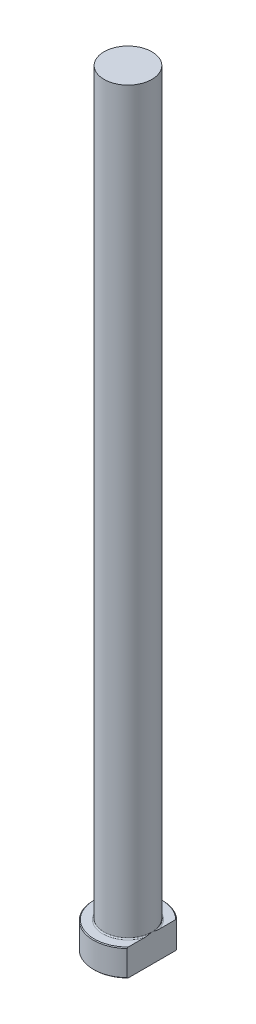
ISO-10303-21;
HEADER;
FILE_DESCRIPTION(('STEP AP214'),'2;1');
FILE_NAME('part.step','',(''),(''),'','','');
FILE_SCHEMA(('AUTOMOTIVE_DESIGN { 1 0 10303 214 1 1 1 1 }'));
ENDSEC;
DATA;
#1=APPLICATION_CONTEXT('core data for automotive mechanical design processes');
#2=APPLICATION_PROTOCOL_DEFINITION('international standard','automotive_design',2000,#1);
#3=PRODUCT_CONTEXT('',#1,'mechanical');
#4=PRODUCT('Part','Part','',(#3));
#5=PRODUCT_RELATED_PRODUCT_CATEGORY('part','',(#4));
#6=PRODUCT_DEFINITION_FORMATION('','',#4);
#7=PRODUCT_DEFINITION_CONTEXT('part definition',#1,'design');
#8=PRODUCT_DEFINITION('design','',#6,#7);
#9=PRODUCT_DEFINITION_SHAPE('','',#8);
#10=(LENGTH_UNIT() NAMED_UNIT(*) SI_UNIT(.MILLI.,.METRE.));
#11=(NAMED_UNIT(*) PLANE_ANGLE_UNIT() SI_UNIT($,.RADIAN.));
#12=(NAMED_UNIT(*) SI_UNIT($,.STERADIAN.) SOLID_ANGLE_UNIT());
#13=UNCERTAINTY_MEASURE_WITH_UNIT(LENGTH_MEASURE(1.E-05),#10,'distance_accuracy_value','');
#14=(GEOMETRIC_REPRESENTATION_CONTEXT(3) GLOBAL_UNCERTAINTY_ASSIGNED_CONTEXT((#13)) GLOBAL_UNIT_ASSIGNED_CONTEXT((#10,
#11,#12)) REPRESENTATION_CONTEXT('',''));
#15=CARTESIAN_POINT('',(0.,0.,0.));
#16=DIRECTION('',(0.,0.,1.));
#17=DIRECTION('',(1.,0.,0.));
#18=AXIS2_PLACEMENT_3D('',#15,#16,#17);
#19=CARTESIAN_POINT('',(0.,0.,0.));
#20=DIRECTION('',(0.,-1.,0.));
#21=DIRECTION('',(0.,0.,-1.));
#22=AXIS2_PLACEMENT_3D('',#19,#20,#21);
#23=PLANE('',#22);
#24=CARTESIAN_POINT('',(0.,0.,0.));
#25=DIRECTION('',(0.,-1.,0.));
#26=DIRECTION('',(0.,0.,-1.));
#27=AXIS2_PLACEMENT_3D('',#24,#25,#26);
#28=CIRCLE('',#27,8.79999999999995);
#29=CARTESIAN_POINT('',(6.24999999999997,0.,6.19495762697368));
#30=VERTEX_POINT('',#29);
#31=CARTESIAN_POINT('',(6.24999999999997,0.,-6.19495762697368));
#32=VERTEX_POINT('',#31);
#33=EDGE_CURVE('E98',#30,#32,#28,.T.);
#34=ORIENTED_EDGE('',*,*,#33,.T.);
#35=DIRECTION('',(0.,0.,1.));
#36=VECTOR('',#35,1.);
#37=CARTESIAN_POINT('',(6.24999999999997,0.,-6.47591692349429));
#38=LINE('',#37,#36);
#39=EDGE_CURVE('E83',#32,#30,#38,.T.);
#40=ORIENTED_EDGE('',*,*,#39,.T.);
#41=EDGE_LOOP('',(#34,#40));
#42=FACE_BOUND('',#41,.T.);
#43=ADVANCED_FACE('F32',(#42),#23,.T.);
#44=CARTESIAN_POINT('',(0.,259.958771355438,0.));
#45=DIRECTION('',(0.,1.,0.));
#46=DIRECTION('',(0.,0.,1.));
#47=AXIS2_PLACEMENT_3D('',#44,#45,#46);
#48=CYLINDRICAL_SURFACE('',#47,8.99999999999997);
#49=CARTESIAN_POINT('',(0.,6.80000000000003,0.));
#50=DIRECTION('',(0.,1.,0.));
#51=DIRECTION('',(0.,0.,1.));
#52=AXIS2_PLACEMENT_3D('',#49,#50,#51);
#53=CIRCLE('',#52,8.99999999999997);
#54=CARTESIAN_POINT('',(6.24999999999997,6.80000000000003,6.47591692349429));
#55=VERTEX_POINT('',#54);
#56=CARTESIAN_POINT('',(6.24999999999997,6.80000000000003,-6.47591692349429));
#57=VERTEX_POINT('',#56);
#58=EDGE_CURVE('E104',#55,#57,#53,.F.);
#59=ORIENTED_EDGE('',*,*,#58,.T.);
#60=DIRECTION('',(0.,-1.,0.));
#61=VECTOR('',#60,1.);
#62=CARTESIAN_POINT('',(6.24999999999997,200.,-6.47591692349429));
#63=LINE('',#62,#61);
#64=CARTESIAN_POINT('',(6.24999999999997,0.200000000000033,-6.47591692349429));
#65=VERTEX_POINT('',#64);
#66=EDGE_CURVE('E183',#57,#65,#63,.T.);
#67=ORIENTED_EDGE('',*,*,#66,.T.);
#68=CARTESIAN_POINT('',(0.,0.200000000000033,0.));
#69=DIRECTION('',(0.,-1.,0.));
#70=DIRECTION('',(0.,0.,-1.));
#71=AXIS2_PLACEMENT_3D('',#68,#69,#70);
#72=CIRCLE('',#71,8.99999999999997);
#73=CARTESIAN_POINT('',(6.24999999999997,0.200000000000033,6.47591692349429));
#74=VERTEX_POINT('',#73);
#75=EDGE_CURVE('E100',#65,#74,#72,.F.);
#76=ORIENTED_EDGE('',*,*,#75,.T.);
#77=DIRECTION('',(0.,-1.,0.));
#78=VECTOR('',#77,1.);
#79=CARTESIAN_POINT('',(6.24999999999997,200.,6.47591692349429));
#80=LINE('',#79,#78);
#81=EDGE_CURVE('E93',#55,#74,#80,.T.);
#82=ORIENTED_EDGE('',*,*,#81,.F.);
#83=EDGE_LOOP('',(#59,#67,#76,#82));
#84=FACE_BOUND('',#83,.T.);
#85=ADVANCED_FACE('F158',(#84),#48,.T.);
#86=CARTESIAN_POINT('',(-8.99999999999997,7.,0.));
#87=DIRECTION('',(0.,1.,0.));
#88=DIRECTION('',(0.,0.,1.));
#89=AXIS2_PLACEMENT_3D('',#86,#87,#88);
#90=PLANE('',#89);
#91=CARTESIAN_POINT('',(0.,7.,0.));
#92=DIRECTION('',(0.,1.,0.));
#93=DIRECTION('',(0.,0.,1.));
#94=AXIS2_PLACEMENT_3D('',#91,#92,#93);
#95=CIRCLE('',#94,8.79999999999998);
#96=CARTESIAN_POINT('',(6.24999999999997,7.,-6.19495762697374));
#97=VERTEX_POINT('',#96);
#98=CARTESIAN_POINT('',(6.24999999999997,7.,6.19495762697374));
#99=VERTEX_POINT('',#98);
#100=EDGE_CURVE('E178',#97,#99,#95,.T.);
#101=ORIENTED_EDGE('',*,*,#100,.T.);
#102=DIRECTION('',(0.,0.,-1.));
#103=VECTOR('',#102,1.);
#104=CARTESIAN_POINT('',(6.24999999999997,7.,0.));
#105=LINE('',#104,#103);
#106=CARTESIAN_POINT('',(6.24999999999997,6.99999999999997,1.95959179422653));
#107=VERTEX_POINT('',#106);
#108=EDGE_CURVE('E57',#99,#107,#105,.T.);
#109=ORIENTED_EDGE('',*,*,#108,.T.);
#110=CARTESIAN_POINT('',(0.,7.,0.));
#111=DIRECTION('',(0.,1.,0.));
#112=DIRECTION('',(0.,0.,1.));
#113=AXIS2_PLACEMENT_3D('',#110,#111,#112);
#114=CIRCLE('',#113,6.54999999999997);
#115=CARTESIAN_POINT('',(6.24999999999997,6.99999999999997,-1.95959179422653));
#116=VERTEX_POINT('',#115);
#117=EDGE_CURVE('E107',#107,#116,#114,.F.);
#118=ORIENTED_EDGE('',*,*,#117,.T.);
#119=EDGE_CURVE('E136',#116,#97,#105,.T.);
#120=ORIENTED_EDGE('',*,*,#119,.T.);
#121=EDGE_LOOP('',(#101,#109,#118,#120));
#122=FACE_BOUND('',#121,.T.);
#123=ADVANCED_FACE('F147',(#122),#90,.T.);
#124=CARTESIAN_POINT('',(0.,7.00000000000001,0.));
#125=DIRECTION('',(0.,-1.,0.));
#126=DIRECTION('',(0.,0.,-1.));
#127=AXIS2_PLACEMENT_3D('',#124,#125,#126);
#128=CONICAL_SURFACE('',#127,8.79999999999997,0.785398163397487);
#129=ORIENTED_EDGE('',*,*,#58,.F.);
#130=CARTESIAN_POINT('',(6.24999999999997,0.241333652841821,14.2481436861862));
#131=CARTESIAN_POINT('',(6.24999999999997,0.433510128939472,14.0382871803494));
#132=CARTESIAN_POINT('',(6.24999999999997,0.625318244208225,13.8280934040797));
#133=CARTESIAN_POINT('',(6.24999999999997,1.00808847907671,13.4069339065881));
#134=CARTESIAN_POINT('',(6.24999999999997,1.19905059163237,13.1959681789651));
#135=CARTESIAN_POINT('',(6.24999999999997,1.77058893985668,12.5616726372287));
#136=CARTESIAN_POINT('',(6.24999999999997,2.14972657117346,12.1370432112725));
#137=CARTESIAN_POINT('',(6.24999999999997,2.90544742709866,11.2804244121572));
#138=CARTESIAN_POINT('',(6.24999999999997,3.28199640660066,10.8484047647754));
#139=CARTESIAN_POINT('',(6.24999999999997,4.02800319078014,9.97835973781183));
#140=CARTESIAN_POINT('',(6.24999999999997,4.39746188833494,9.5403351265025));
#141=CARTESIAN_POINT('',(6.24999999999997,5.0661955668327,8.72902037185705));
#142=CARTESIAN_POINT('',(6.24999999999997,5.36698522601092,8.35698524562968));
#143=CARTESIAN_POINT('',(6.24999999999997,5.81091107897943,7.79312105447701));
#144=CARTESIAN_POINT('',(6.24999999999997,5.95769918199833,7.60416746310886));
#145=CARTESIAN_POINT('',(6.24999999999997,6.24834991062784,7.22402635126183));
#146=CARTESIAN_POINT('',(6.24999999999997,6.39221261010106,7.03283888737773));
#147=CARTESIAN_POINT('',(6.24999999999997,6.67624882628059,6.64809388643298));
#148=CARTESIAN_POINT('',(6.24999999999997,6.81642658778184,6.45453948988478));
#149=CARTESIAN_POINT('',(6.24999999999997,7.092500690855,6.06440831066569));
#150=CARTESIAN_POINT('',(6.24999999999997,7.22839726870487,5.86783169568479));
#151=CARTESIAN_POINT('',(6.24999999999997,7.49487226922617,5.47121725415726));
#152=CARTESIAN_POINT('',(6.24999999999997,7.62545297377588,5.27118096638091));
#153=CARTESIAN_POINT('',(6.24999999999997,7.88005759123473,4.86699392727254));
#154=CARTESIAN_POINT('',(6.24999999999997,8.00408234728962,4.66284370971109));
#155=CARTESIAN_POINT('',(6.24999999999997,8.24192682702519,4.2531554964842));
#156=CARTESIAN_POINT('',(6.24999999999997,8.35588135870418,4.04769623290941));
#157=CARTESIAN_POINT('',(6.24999999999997,8.57376120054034,3.63145654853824));
#158=CARTESIAN_POINT('',(6.24999999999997,8.67768550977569,3.42067559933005));
#159=CARTESIAN_POINT('',(6.24999999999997,8.87268822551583,2.9935272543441));
#160=CARTESIAN_POINT('',(6.24999999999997,8.96378316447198,2.77716748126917));
#161=CARTESIAN_POINT('',(6.24999999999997,9.12997532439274,2.33835397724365));
#162=CARTESIAN_POINT('',(6.24999999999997,9.20507709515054,2.11590199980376));
#163=CARTESIAN_POINT('',(6.24999999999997,9.32245998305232,1.71047588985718));
#164=CARTESIAN_POINT('',(6.24999999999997,9.36830307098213,1.52853906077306));
#165=CARTESIAN_POINT('',(6.24999999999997,9.44550018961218,1.16159607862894));
#166=CARTESIAN_POINT('',(6.24999999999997,9.47685624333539,0.976590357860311));
#167=CARTESIAN_POINT('',(6.24999999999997,9.52348341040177,0.60500414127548));
#168=CARTESIAN_POINT('',(6.24999999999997,9.53879458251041,0.418428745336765));
#169=CARTESIAN_POINT('',(6.24999999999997,9.55263073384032,0.0446485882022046));
#170=CARTESIAN_POINT('',(6.24999999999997,9.55115595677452,-0.142556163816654));
#171=CARTESIAN_POINT('',(6.24999999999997,9.53151010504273,-0.515964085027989));
#172=CARTESIAN_POINT('',(6.24999999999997,9.51334871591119,-0.702167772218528));
#173=CARTESIAN_POINT('',(6.24999999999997,9.46132296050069,-1.07235055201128));
#174=CARTESIAN_POINT('',(6.24999999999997,9.42745724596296,-1.25632945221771));
#175=CARTESIAN_POINT('',(6.24999999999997,9.34551825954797,-1.62161387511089));
#176=CARTESIAN_POINT('',(6.24999999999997,9.29740414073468,-1.80291011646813));
#177=CARTESIAN_POINT('',(6.24999999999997,9.18891949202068,-2.16174722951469));
#178=CARTESIAN_POINT('',(6.24999999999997,9.12854919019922,-2.3392881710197));
#179=CARTESIAN_POINT('',(6.24999999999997,8.98038960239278,-2.73619642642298));
#180=CARTESIAN_POINT('',(6.24999999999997,8.88955370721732,-2.95442044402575));
#181=CARTESIAN_POINT('',(6.24999999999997,8.69480317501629,-3.3850000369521));
#182=CARTESIAN_POINT('',(6.24999999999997,8.59088203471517,-3.59735262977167));
#183=CARTESIAN_POINT('',(6.24999999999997,8.37253952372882,-4.01706977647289));
#184=CARTESIAN_POINT('',(6.24999999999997,8.25809823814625,-4.22442389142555));
#185=CARTESIAN_POINT('',(6.24999999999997,8.02107167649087,-4.63434772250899));
#186=CARTESIAN_POINT('',(6.24999999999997,7.89848770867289,-4.83691820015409));
#187=CARTESIAN_POINT('',(6.24999999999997,7.64548625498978,-5.24008406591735));
#188=CARTESIAN_POINT('',(6.24999999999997,7.5149995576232,-5.44063581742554));
#189=CARTESIAN_POINT('',(6.24999999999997,7.24868510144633,-5.83817237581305));
#190=CARTESIAN_POINT('',(6.24999999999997,7.11285688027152,-6.03515687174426));
#191=CARTESIAN_POINT('',(6.24999999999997,6.83683288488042,-6.42612120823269));
#192=CARTESIAN_POINT('',(6.24999999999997,6.69663581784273,-6.62010013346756));
#193=CARTESIAN_POINT('',(6.24999999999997,6.41268260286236,-7.00543858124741));
#194=CARTESIAN_POINT('',(6.24999999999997,6.26892633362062,-7.19679801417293));
#195=CARTESIAN_POINT('',(6.24999999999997,5.89056224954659,-7.69242940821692));
#196=CARTESIAN_POINT('',(6.24999999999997,5.65363599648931,-7.99493062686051));
#197=CARTESIAN_POINT('',(6.24999999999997,5.17412949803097,-8.59529922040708));
#198=CARTESIAN_POINT('',(6.24999999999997,4.93155037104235,-8.89316749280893));
#199=CARTESIAN_POINT('',(6.24999999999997,4.44181409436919,-9.48544309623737));
#200=CARTESIAN_POINT('',(6.24999999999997,4.19465400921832,-9.7798479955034));
#201=CARTESIAN_POINT('',(6.24999999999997,3.69683790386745,-10.3657062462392));
#202=CARTESIAN_POINT('',(6.24999999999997,3.44618171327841,-10.6571594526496));
#203=CARTESIAN_POINT('',(6.24999999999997,2.9519944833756,-11.2262122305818));
#204=CARTESIAN_POINT('',(6.24999999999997,2.70857128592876,-11.5039055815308));
#205=CARTESIAN_POINT('',(6.24999999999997,2.21961081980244,-12.0574158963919));
#206=CARTESIAN_POINT('',(6.24999999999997,1.97407358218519,-12.3332328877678));
#207=CARTESIAN_POINT('',(6.24999999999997,1.48150971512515,-12.8829958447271));
#208=CARTESIAN_POINT('',(6.24999999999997,1.23448497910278,-13.1569435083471));
#209=CARTESIAN_POINT('',(6.24999999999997,0.738953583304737,-13.7034947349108));
#210=CARTESIAN_POINT('',(6.24999999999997,0.490446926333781,-13.9760983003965));
#211=CARTESIAN_POINT('',(6.24999999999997,0.241333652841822,-14.2481436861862));
#212=B_SPLINE_CURVE_WITH_KNOTS('',3,(#130,#131,#132,#133,#134,#135,#136,#137,#138,#139,#140,
#141,#142,#143,#144,#145,#146,#147,#148,#149,#150,#151,#152,#153,#154,#155,#156,#157,#158,#159,
#160,#161,#162,#163,#164,#165,#166,#167,#168,#169,#170,#171,#172,#173,#174,#175,#176,#177,#178,
#179,#180,#181,#182,#183,#184,#185,#186,#187,#188,#189,#190,#191,#192,#193,#194,#195,#196,#197,
#198,#199,#200,#201,#202,#203,#204,#205,#206,#207,#208,#209,#210,#211),.UNSPECIFIED.,.F.,.F.,(4,
2,2,2,2,2,2,2,2,2,2,2,2,2,2,2,2,2,2,2,2,2,2,2,2,2,2,2,2,2,2,2,2,2,2,2,2,2,2,2,4),(0.,
0.85366417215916,1.70733543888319,3.41508002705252,5.13429133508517,6.85328470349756,
8.28840776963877,9.00619588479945,9.72396585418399,10.4408691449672,11.15773280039,
11.8742854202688,12.5907456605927,13.2953619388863,14.0000484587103,14.7038184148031,
15.4073878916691,15.9697505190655,16.5320345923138,17.0929114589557,17.6537801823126,
18.2143235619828,18.7749150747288,19.3371294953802,19.8993334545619,20.6078926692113,
21.3168054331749,22.0270889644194,22.7372586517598,23.4549493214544,24.1727022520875,
24.8906696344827,25.608661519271,26.7612833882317,27.9136791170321,29.0668407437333,
30.220058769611,31.3278889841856,32.4357029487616,33.5423213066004,34.6489375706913),.UNSPECIFIED.);
#213=EDGE_CURVE('E135',#55,#99,#212,.T.);
#214=ORIENTED_EDGE('',*,*,#213,.T.);
#215=ORIENTED_EDGE('',*,*,#100,.F.);
#216=EDGE_CURVE('E127',#97,#57,#212,.T.);
#217=ORIENTED_EDGE('',*,*,#216,.T.);
#218=EDGE_LOOP('',(#129,#214,#215,#217));
#219=FACE_BOUND('',#218,.T.);
#220=ADVANCED_FACE('F143',(#219),#128,.T.);
#221=CARTESIAN_POINT('',(0.,0.200000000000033,0.));
#222=DIRECTION('',(0.,1.,0.));
#223=DIRECTION('',(0.,0.,1.));
#224=AXIS2_PLACEMENT_3D('',#221,#222,#223);
#225=CONICAL_SURFACE('',#224,8.99999999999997,0.785398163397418);
#226=ORIENTED_EDGE('',*,*,#75,.F.);
#227=CARTESIAN_POINT('',(6.24999999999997,6.75866634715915,-14.2481436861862));
#228=CARTESIAN_POINT('',(6.24999999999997,6.56648987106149,-14.0382871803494));
#229=CARTESIAN_POINT('',(6.24999999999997,6.37468175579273,-13.8280934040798));
#230=CARTESIAN_POINT('',(6.24999999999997,5.99191152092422,-13.4069339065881));
#231=CARTESIAN_POINT('',(6.24999999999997,5.80094940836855,-13.1959681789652));
#232=CARTESIAN_POINT('',(6.24999999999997,5.22941106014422,-12.5616726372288));
#233=CARTESIAN_POINT('',(6.24999999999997,4.85027342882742,-12.1370432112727));
#234=CARTESIAN_POINT('',(6.24999999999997,4.09455257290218,-11.2804244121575));
#235=CARTESIAN_POINT('',(6.24999999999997,3.71800359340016,-10.8484047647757));
#236=CARTESIAN_POINT('',(6.24999999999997,2.97199680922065,-9.97835973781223));
#237=CARTESIAN_POINT('',(6.24999999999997,2.60253811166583,-9.54033512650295));
#238=CARTESIAN_POINT('',(6.24999999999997,1.93380443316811,-8.72902037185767));
#239=CARTESIAN_POINT('',(6.24999999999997,1.63301477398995,-8.35698524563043));
#240=CARTESIAN_POINT('',(6.24999999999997,1.18908892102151,-7.79312105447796));
#241=CARTESIAN_POINT('',(6.24999999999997,1.04230081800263,-7.60416746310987));
#242=CARTESIAN_POINT('',(6.24999999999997,0.751650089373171,-7.22402635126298));
#243=CARTESIAN_POINT('',(6.24999999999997,0.607787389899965,-7.03283888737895));
#244=CARTESIAN_POINT('',(6.24999999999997,0.323751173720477,-6.64809388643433));
#245=CARTESIAN_POINT('',(6.24999999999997,0.183573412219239,-6.4545394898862));
#246=CARTESIAN_POINT('',(6.24999999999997,-0.0925006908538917,-6.06440831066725));
#247=CARTESIAN_POINT('',(6.24999999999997,-0.228397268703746,-5.86783169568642));
#248=CARTESIAN_POINT('',(6.24999999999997,-0.494872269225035,-5.47121725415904));
#249=CARTESIAN_POINT('',(6.24999999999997,-0.62545297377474,-5.27118096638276));
#250=CARTESIAN_POINT('',(6.24999999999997,-0.880057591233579,-4.86699392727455));
#251=CARTESIAN_POINT('',(6.24999999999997,-1.00408234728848,-4.66284370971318));
#252=CARTESIAN_POINT('',(6.24999999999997,-1.24192682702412,-4.25315549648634));
#253=CARTESIAN_POINT('',(6.24999999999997,-1.35588135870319,-4.04769623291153));
#254=CARTESIAN_POINT('',(6.24999999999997,-1.57376120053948,-3.63145654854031));
#255=CARTESIAN_POINT('',(6.24999999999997,-1.67768550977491,-3.42067559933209));
#256=CARTESIAN_POINT('',(6.24999999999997,-1.8726882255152,-2.99352725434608));
#257=CARTESIAN_POINT('',(6.24999999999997,-1.96378316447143,-2.77716748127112));
#258=CARTESIAN_POINT('',(6.24999999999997,-2.12997532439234,-2.33835397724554));
#259=CARTESIAN_POINT('',(6.24999999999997,-2.20507709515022,-2.11590199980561));
#260=CARTESIAN_POINT('',(6.24999999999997,-2.32245998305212,-1.71047588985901));
#261=CARTESIAN_POINT('',(6.24999999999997,-2.36830307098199,-1.5285390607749));
#262=CARTESIAN_POINT('',(6.24999999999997,-2.44550018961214,-1.16159607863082));
#263=CARTESIAN_POINT('',(6.24999999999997,-2.47685624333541,-0.976590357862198));
#264=CARTESIAN_POINT('',(6.24999999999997,-2.5234834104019,-0.605004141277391));
#265=CARTESIAN_POINT('',(6.24999999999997,-2.5387945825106,-0.418428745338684));
#266=CARTESIAN_POINT('',(6.24999999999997,-2.55263073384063,-0.0446485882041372));
#267=CARTESIAN_POINT('',(6.24999999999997,-2.55115595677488,0.142556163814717));
#268=CARTESIAN_POINT('',(6.24999999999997,-2.53151010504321,0.515964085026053));
#269=CARTESIAN_POINT('',(6.24999999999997,-2.51334871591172,0.702167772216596));
#270=CARTESIAN_POINT('',(6.24999999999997,-2.46132296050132,1.07235055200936));
#271=CARTESIAN_POINT('',(6.24999999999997,-2.42745724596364,1.2563294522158));
#272=CARTESIAN_POINT('',(6.24999999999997,-2.34551825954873,1.621613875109));
#273=CARTESIAN_POINT('',(6.24999999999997,-2.29740414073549,1.80291011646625));
#274=CARTESIAN_POINT('',(6.24999999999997,-2.18891949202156,2.16174722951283));
#275=CARTESIAN_POINT('',(6.24999999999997,-2.12854919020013,2.33928817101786));
#276=CARTESIAN_POINT('',(6.24999999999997,-1.98038960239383,2.73619642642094));
#277=CARTESIAN_POINT('',(6.24999999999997,-1.8895537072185,2.9544204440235));
#278=CARTESIAN_POINT('',(6.24999999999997,-1.69480317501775,3.38500003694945));
#279=CARTESIAN_POINT('',(6.24999999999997,-1.59088203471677,3.59735262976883));
#280=CARTESIAN_POINT('',(6.24999999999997,-1.37253952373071,4.01706977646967));
#281=CARTESIAN_POINT('',(6.24999999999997,-1.2580982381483,4.22442389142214));
#282=CARTESIAN_POINT('',(6.24999999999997,-1.02107167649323,4.6343477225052));
#283=CARTESIAN_POINT('',(6.24999999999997,-0.898487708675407,4.83691820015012));
#284=CARTESIAN_POINT('',(6.24999999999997,-0.645486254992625,5.24008406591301));
#285=CARTESIAN_POINT('',(6.24999999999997,-0.514999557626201,5.44063581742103));
#286=CARTESIAN_POINT('',(6.24999999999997,-0.248685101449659,5.83817237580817));
#287=CARTESIAN_POINT('',(6.24999999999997,-0.112856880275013,6.03515687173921));
#288=CARTESIAN_POINT('',(6.24999999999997,0.163167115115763,6.42612120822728));
#289=CARTESIAN_POINT('',(6.24999999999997,0.303364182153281,6.62010013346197));
#290=CARTESIAN_POINT('',(6.24999999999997,0.587317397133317,7.00543858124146));
#291=CARTESIAN_POINT('',(6.24999999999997,0.731073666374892,7.19679801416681));
#292=CARTESIAN_POINT('',(6.24999999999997,1.10943775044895,7.69242940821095));
#293=CARTESIAN_POINT('',(6.24999999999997,1.34636400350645,7.99493062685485));
#294=CARTESIAN_POINT('',(6.24999999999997,1.82587050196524,8.59529922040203));
#295=CARTESIAN_POINT('',(6.24999999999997,2.06844962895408,8.89316749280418));
#296=CARTESIAN_POINT('',(6.24999999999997,2.55818590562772,9.4854430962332));
#297=CARTESIAN_POINT('',(6.24999999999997,2.80534599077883,9.77984799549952));
#298=CARTESIAN_POINT('',(6.24999999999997,3.3031620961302,10.3657062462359));
#299=CARTESIAN_POINT('',(6.24999999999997,3.55381828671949,10.6571594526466));
#300=CARTESIAN_POINT('',(6.24999999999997,4.04800551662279,11.2262122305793));
#301=CARTESIAN_POINT('',(6.24999999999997,4.29142871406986,11.5039055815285));
#302=CARTESIAN_POINT('',(6.24999999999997,4.78038918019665,12.0574158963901));
#303=CARTESIAN_POINT('',(6.24999999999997,5.02592641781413,12.3332328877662));
#304=CARTESIAN_POINT('',(6.24999999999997,5.51849028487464,12.882995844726));
#305=CARTESIAN_POINT('',(6.24999999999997,5.76551502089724,13.1569435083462));
#306=CARTESIAN_POINT('',(6.24999999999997,6.26104641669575,13.7034947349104));
#307=CARTESIAN_POINT('',(6.24999999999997,6.50955307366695,13.9760983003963));
#308=CARTESIAN_POINT('',(6.24999999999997,6.75866634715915,14.2481436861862));
#309=B_SPLINE_CURVE_WITH_KNOTS('',3,(#227,#228,#229,#230,#231,#232,#233,#234,#235,#236,#237,
#238,#239,#240,#241,#242,#243,#244,#245,#246,#247,#248,#249,#250,#251,#252,#253,#254,#255,#256,
#257,#258,#259,#260,#261,#262,#263,#264,#265,#266,#267,#268,#269,#270,#271,#272,#273,#274,#275,
#276,#277,#278,#279,#280,#281,#282,#283,#284,#285,#286,#287,#288,#289,#290,#291,#292,#293,#294,
#295,#296,#297,#298,#299,#300,#301,#302,#303,#304,#305,#306,#307,#308),.UNSPECIFIED.,.F.,.F.,(4,
2,2,2,2,2,2,2,2,2,2,2,2,2,2,2,2,2,2,2,2,2,2,2,2,2,2,2,2,2,2,2,2,2,2,2,2,2,2,2,4),(0.,
0.853664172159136,1.70733543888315,3.41508002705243,5.13429133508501,6.85328470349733,
8.28840776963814,9.00619588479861,9.72396585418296,10.440869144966,11.1577328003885,
11.8742854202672,12.5907456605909,13.2953619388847,14.0000484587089,14.7038184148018,
15.407387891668,15.9697505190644,16.5320345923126,17.0929114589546,17.6537801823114,
18.2143235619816,18.7749150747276,19.3371294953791,19.8993334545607,20.6078926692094,
21.3168054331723,22.027088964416,22.7372586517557,23.4549493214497,24.172702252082,
24.8906696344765,25.6086615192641,26.7612833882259,27.9136791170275,29.0668407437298,
30.2200587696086,31.3278889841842,32.4357029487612,33.5423213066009,34.6489375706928),.UNSPECIFIED.);
#310=EDGE_CURVE('E86',#65,#32,#309,.T.);
#311=ORIENTED_EDGE('',*,*,#310,.T.);
#312=ORIENTED_EDGE('',*,*,#33,.F.);
#313=EDGE_CURVE('E89',#30,#74,#309,.T.);
#314=ORIENTED_EDGE('',*,*,#313,.T.);
#315=EDGE_LOOP('',(#226,#311,#312,#314));
#316=FACE_BOUND('',#315,.T.);
#317=ADVANCED_FACE('F97',(#316),#225,.T.);
#318=CARTESIAN_POINT('',(0.,7.29999999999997,0.));
#319=DIRECTION('',(0.,1.,0.));
#320=DIRECTION('',(0.,0.,1.));
#321=AXIS2_PLACEMENT_3D('',#318,#319,#320);
#322=TOROIDAL_SURFACE('',#321,6.54999999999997,0.3);
#323=CARTESIAN_POINT('',(6.24999999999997,7.29999999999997,0.));
#324=CARTESIAN_POINT('',(6.24999999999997,7.30000062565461,1.07935811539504E-10));
#325=CARTESIAN_POINT('',(6.24999999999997,7.30000125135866,-2.93503388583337E-07));
#326=CARTESIAN_POINT('',(6.24999999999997,7.300002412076,-1.07409020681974E-06));
#327=CARTESIAN_POINT('',(6.24999999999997,7.30000292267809,-1.58214987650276E-06));
#328=CARTESIAN_POINT('',(6.24999999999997,7.30000400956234,-2.8081901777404E-06));
#329=CARTESIAN_POINT('',(6.24999999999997,7.30000456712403,-3.54604295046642E-06));
#330=CARTESIAN_POINT('',(6.24999999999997,7.30000554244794,-5.05412397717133E-06));
#331=CARTESIAN_POINT('',(6.24999999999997,7.30000596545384,-5.82130991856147E-06));
#332=CARTESIAN_POINT('',(6.24999999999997,7.30000759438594,-8.87270548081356E-06));
#333=CARTESIAN_POINT('',(6.24999999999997,7.30000872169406,-1.1203275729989E-05));
#334=CARTESIAN_POINT('',(6.24999999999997,7.30001051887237,-1.57552363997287E-05));
#335=CARTESIAN_POINT('',(6.24999999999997,7.30001122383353,-1.79632548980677E-05));
#336=CARTESIAN_POINT('',(6.24999999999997,7.30001427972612,-2.752581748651E-05));
#337=CARTESIAN_POINT('',(6.24999999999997,7.30001663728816,-3.48805238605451E-05));
#338=CARTESIAN_POINT('',(6.24999999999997,7.30002001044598,-4.8619148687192E-05));
#339=CARTESIAN_POINT('',(6.24999999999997,7.30002118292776,-5.49639235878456E-05));
#340=CARTESIAN_POINT('',(6.24999999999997,7.30002986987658,-0.000102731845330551));
#341=CARTESIAN_POINT('',(6.24999999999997,7.30003662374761,-0.000144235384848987));
#342=CARTESIAN_POINT('',(6.24999999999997,7.30006617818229,-0.000309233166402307));
#343=CARTESIAN_POINT('',(6.24999999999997,7.3000942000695,-0.000431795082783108));
#344=CARTESIAN_POINT('',(6.24999999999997,7.30020410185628,-0.000919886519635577));
#345=CARTESIAN_POINT('',(6.24999999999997,7.3002827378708,-0.00128589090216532));
#346=CARTESIAN_POINT('',(6.24999999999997,7.30059929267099,-0.00274922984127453));
#347=CARTESIAN_POINT('',(6.24999999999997,7.30084138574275,-0.00384592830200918));
#348=CARTESIAN_POINT('',(6.24999999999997,7.30185366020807,-0.00844291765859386));
#349=CARTESIAN_POINT('',(6.24999999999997,7.30261854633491,-0.0119440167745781));
#350=CARTESIAN_POINT('',(6.24999999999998,7.30934535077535,-0.0427197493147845));
#351=CARTESIAN_POINT('',(6.24999999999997,7.31532845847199,-0.0699912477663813));
#352=CARTESIAN_POINT('',(6.24999999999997,7.32701994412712,-0.1234289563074));
#353=CARTESIAN_POINT('',(6.24999999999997,7.33272958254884,-0.14959492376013));
#354=CARTESIAN_POINT('',(6.24999999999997,7.34485779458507,-0.205323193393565));
#355=CARTESIAN_POINT('',(6.24999999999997,7.35127239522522,-0.23488638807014));
#356=CARTESIAN_POINT('',(6.24999999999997,7.36411066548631,-0.294356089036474));
#357=CARTESIAN_POINT('',(6.24999999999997,7.37053363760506,-0.324262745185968));
#358=CARTESIAN_POINT('',(6.24999999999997,7.38584616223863,-0.396051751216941));
#359=CARTESIAN_POINT('',(6.24999999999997,7.39469543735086,-0.437942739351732));
#360=CARTESIAN_POINT('',(6.24999999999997,7.41192932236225,-0.520630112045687));
#361=CARTESIAN_POINT('',(6.24999999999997,7.42032002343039,-0.561425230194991));
#362=CARTESIAN_POINT('',(6.24999999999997,7.44742205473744,-0.69545636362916));
#363=CARTESIAN_POINT('',(6.24999999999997,7.4655604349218,-0.788810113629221));
#364=CARTESIAN_POINT('',(6.24999999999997,7.49982037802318,-0.976827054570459));
#365=CARTESIAN_POINT('',(6.24999999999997,7.51592073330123,-1.07149417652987));
#366=CARTESIAN_POINT('',(6.24999999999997,7.54633300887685,-1.27034734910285));
#367=CARTESIAN_POINT('',(6.24999999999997,7.56032934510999,-1.37458266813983));
#368=CARTESIAN_POINT('',(6.24999999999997,7.58288660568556,-1.58337219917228));
#369=CARTESIAN_POINT('',(6.24999999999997,7.59146383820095,-1.68792449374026));
#370=CARTESIAN_POINT('',(6.24999999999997,7.59839530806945,-1.84328437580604));
#371=CARTESIAN_POINT('',(6.24999999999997,7.59974160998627,-1.89395725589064));
#372=CARTESIAN_POINT('',(6.24999999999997,7.60019235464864,-1.99536854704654));
#373=CARTESIAN_POINT('',(6.24999999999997,7.59929473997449,-2.04610697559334));
#374=CARTESIAN_POINT('',(6.24999999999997,7.59472992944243,-2.14676570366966));
#375=CARTESIAN_POINT('',(6.24999999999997,7.5911010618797,-2.19668764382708));
#376=CARTESIAN_POINT('',(6.24999999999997,7.58034281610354,-2.29612823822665));
#377=CARTESIAN_POINT('',(6.24999999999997,7.57321785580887,-2.3456473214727));
#378=CARTESIAN_POINT('',(6.24999999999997,7.55883861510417,-2.41968621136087));
#379=CARTESIAN_POINT('',(6.24999999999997,7.55336305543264,-2.44455073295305));
#380=CARTESIAN_POINT('',(6.24999999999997,7.54088765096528,-2.49388968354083));
#381=CARTESIAN_POINT('',(6.24999999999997,7.53388865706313,-2.51836432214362));
#382=CARTESIAN_POINT('',(6.24999999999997,7.5180160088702,-2.56658659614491));
#383=CARTESIAN_POINT('',(6.24999999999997,7.50915079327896,-2.59033697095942));
#384=CARTESIAN_POINT('',(6.24999999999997,7.48896575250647,-2.63675110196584));
#385=CARTESIAN_POINT('',(6.24999999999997,7.47765263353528,-2.65941762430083));
#386=CARTESIAN_POINT('',(6.24999999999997,7.45696632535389,-2.69385500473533));
#387=CARTESIAN_POINT('',(6.24999999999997,7.4486983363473,-2.70628406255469));
#388=CARTESIAN_POINT('',(6.24999999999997,7.43069170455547,-2.73004308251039));
#389=CARTESIAN_POINT('',(6.24999999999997,7.42095514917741,-2.74137456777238));
#390=CARTESIAN_POINT('',(6.24999999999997,7.40313125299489,-2.75886410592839));
#391=CARTESIAN_POINT('',(6.24999999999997,7.39552792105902,-2.76551055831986));
#392=CARTESIAN_POINT('',(6.24999999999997,7.37942171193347,-2.77761940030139));
#393=CARTESIAN_POINT('',(6.24999999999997,7.37092027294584,-2.78308364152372));
#394=CARTESIAN_POINT('',(6.24999999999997,7.3552039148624,-2.79123019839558));
#395=CARTESIAN_POINT('',(6.24999999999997,7.34817405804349,-2.79426565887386));
#396=CARTESIAN_POINT('',(6.24999999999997,7.33371058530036,-2.79914227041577));
#397=CARTESIAN_POINT('',(6.24999999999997,7.32627746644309,-2.80098485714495));
#398=CARTESIAN_POINT('',(6.24999999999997,7.31114486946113,-2.80329865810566));
#399=CARTESIAN_POINT('',(6.24999999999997,7.30344395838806,-2.8037607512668));
#400=CARTESIAN_POINT('',(6.24999999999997,7.28809169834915,-2.80323167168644));
#401=CARTESIAN_POINT('',(6.24999999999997,7.28044035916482,-2.8022402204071));
#402=CARTESIAN_POINT('',(6.24999999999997,7.26612892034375,-2.79907216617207));
#403=CARTESIAN_POINT('',(6.24999999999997,7.25944213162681,-2.79701213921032));
#404=CARTESIAN_POINT('',(6.24999999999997,7.24643877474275,-2.79195274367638));
#405=CARTESIAN_POINT('',(6.24999999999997,7.24012234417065,-2.78895302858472));
#406=CARTESIAN_POINT('',(6.24999999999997,7.2241404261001,-2.78010234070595));
#407=CARTESIAN_POINT('',(6.24999999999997,7.21481747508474,-2.77363492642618));
#408=CARTESIAN_POINT('',(6.24999999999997,7.19727307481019,-2.75934472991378));
#409=CARTESIAN_POINT('',(6.24999999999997,7.18905534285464,-2.75151756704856));
#410=CARTESIAN_POINT('',(6.24999999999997,7.16746274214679,-2.72838666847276));
#411=CARTESIAN_POINT('',(6.24999999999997,7.15517318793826,-2.71208063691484));
#412=CARTESIAN_POINT('',(6.24999999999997,7.13297830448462,-2.67797126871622));
#413=CARTESIAN_POINT('',(6.24999999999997,7.12307686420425,-2.66016555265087));
#414=CARTESIAN_POINT('',(6.24999999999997,7.10185271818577,-2.61712561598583));
#415=CARTESIAN_POINT('',(6.24999999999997,7.09129494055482,-2.59151849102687));
#416=CARTESIAN_POINT('',(6.24999999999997,7.07260379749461,-2.53941658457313));
#417=CARTESIAN_POINT('',(6.24999999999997,7.06447530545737,-2.51292013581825));
#418=CARTESIAN_POINT('',(6.24999999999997,7.05002040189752,-2.45908915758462));
#419=CARTESIAN_POINT('',(6.24999999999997,7.04371803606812,-2.43174827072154));
#420=CARTESIAN_POINT('',(6.24999999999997,7.03267951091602,-2.37679196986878));
#421=CARTESIAN_POINT('',(6.24999999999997,7.0279416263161,-2.34917689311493));
#422=CARTESIAN_POINT('',(6.24999999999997,7.01732549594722,-2.27736486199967));
#423=CARTESIAN_POINT('',(6.24999999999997,7.01243082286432,-2.23302306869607));
#424=CARTESIAN_POINT('',(6.24999999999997,7.00516057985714,-2.1441265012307));
#425=CARTESIAN_POINT('',(6.24999999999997,7.00278642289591,-2.099571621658));
#426=CARTESIAN_POINT('',(6.24999999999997,6.99868217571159,-1.96551117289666));
#427=CARTESIAN_POINT('',(6.24999999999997,7.0000072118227,-1.87591316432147));
#428=CARTESIAN_POINT('',(6.24999999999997,7.0080292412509,-1.70248618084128));
#429=CARTESIAN_POINT('',(6.24999999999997,7.01439439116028,-1.61863796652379));
#430=CARTESIAN_POINT('',(6.24999999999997,7.03083822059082,-1.45127006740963));
#431=CARTESIAN_POINT('',(6.24999999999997,7.04091883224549,-1.3677505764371));
#432=CARTESIAN_POINT('',(6.24999999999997,7.06480380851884,-1.19431308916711));
#433=CARTESIAN_POINT('',(6.24999999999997,7.07884475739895,-1.10442856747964));
#434=CARTESIAN_POINT('',(6.24999999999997,7.10969415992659,-0.922729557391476));
#435=CARTESIAN_POINT('',(6.24999999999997,7.12656524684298,-0.830925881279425));
#436=CARTESIAN_POINT('',(6.24999999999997,7.15670076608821,-0.67515179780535));
#437=CARTESIAN_POINT('',(6.24999999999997,7.16952837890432,-0.611095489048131));
#438=CARTESIAN_POINT('',(6.24999999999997,7.19564112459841,-0.483838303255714));
#439=CARTESIAN_POINT('',(6.24999999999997,7.2089193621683,-0.420636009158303));
#440=CARTESIAN_POINT('',(6.24999999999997,7.23428285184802,-0.301644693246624));
#441=CARTESIAN_POINT('',(6.24999999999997,7.24632762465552,-0.245846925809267));
#442=CARTESIAN_POINT('',(6.24999999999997,7.27113004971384,-0.131848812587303));
#443=CARTESIAN_POINT('',(6.24999999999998,7.28389583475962,-0.0736501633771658));
#444=CARTESIAN_POINT('',(6.24999999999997,7.29738281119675,-0.0119373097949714));
#445=CARTESIAN_POINT('',(6.24999999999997,7.29814924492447,-0.00842953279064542));
#446=CARTESIAN_POINT('',(6.24999999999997,7.2991618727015,-0.00383105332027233));
#447=CARTESIAN_POINT('',(6.24999999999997,7.29940281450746,-0.00273954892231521));
#448=CARTESIAN_POINT('',(6.24999999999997,7.29971797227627,-0.00128266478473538));
#449=CARTESIAN_POINT('',(6.24999999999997,7.29979633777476,-0.000917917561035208));
#450=CARTESIAN_POINT('',(6.24999999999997,7.29990591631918,-0.000431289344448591));
#451=CARTESIAN_POINT('',(6.24999999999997,7.29993389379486,-0.000308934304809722));
#452=CARTESIAN_POINT('',(6.24999999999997,7.29996340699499,-0.00014417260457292));
#453=CARTESIAN_POINT('',(6.24999999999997,7.29997015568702,-0.000102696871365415));
#454=CARTESIAN_POINT('',(6.24999999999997,7.29997883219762,-5.49575231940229E-05));
#455=CARTESIAN_POINT('',(6.24999999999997,7.29998000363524,-4.86141750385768E-05));
#456=CARTESIAN_POINT('',(6.24999999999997,7.29998337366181,-3.48785875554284E-05));
#457=CARTESIAN_POINT('',(6.24999999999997,7.29998572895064,-2.75254181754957E-05));
#458=CARTESIAN_POINT('',(6.24999999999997,7.29998878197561,-1.79644811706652E-05));
#459=CARTESIAN_POINT('',(6.24999999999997,7.29998948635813,-1.57565691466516E-05));
#460=CARTESIAN_POINT('',(6.24999999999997,7.29999128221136,-1.12047374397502E-05));
#461=CARTESIAN_POINT('',(6.24999999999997,7.29999240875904,-8.87417477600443E-06));
#462=CARTESIAN_POINT('',(6.24999999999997,7.29999403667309,-5.82269238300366E-06));
#463=CARTESIAN_POINT('',(6.24999999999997,7.29999445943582,-5.05545097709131E-06));
#464=CARTESIAN_POINT('',(6.24999999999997,7.29999543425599,-3.54721514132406E-06));
#465=CARTESIAN_POINT('',(6.24999999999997,7.29999599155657,-2.80926073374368E-06));
#466=CARTESIAN_POINT('',(6.24999999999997,7.29999707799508,-1.58298694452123E-06));
#467=CARTESIAN_POINT('',(6.24999999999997,7.29999758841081,-1.07480544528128E-06));
#468=CARTESIAN_POINT('',(6.24999999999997,7.29999874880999,-2.93902319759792E-07));
#469=CARTESIAN_POINT('',(6.24999999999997,7.29999937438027,-1.07929784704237E-10));
#470=CARTESIAN_POINT('',(6.24999999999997,7.29999999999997,0.));
#471=B_SPLINE_CURVE_WITH_KNOTS('',3,(#323,#324,#325,#326,#327,#328,#329,#330,#331,#332,#333,
#334,#335,#336,#337,#338,#339,#340,#341,#342,#343,#344,#345,#346,#347,#348,#349,#350,#351,#352,
#353,#354,#355,#356,#357,#358,#359,#360,#361,#362,#363,#364,#365,#366,#367,#368,#369,#370,#371,
#372,#373,#374,#375,#376,#377,#378,#379,#380,#381,#382,#383,#384,#385,#386,#387,#388,#389,#390,
#391,#392,#393,#394,#395,#396,#397,#398,#399,#400,#401,#402,#403,#404,#405,#406,#407,#408,#409,
#410,#411,#412,#413,#414,#415,#416,#417,#418,#419,#420,#421,#422,#423,#424,#425,#426,#427,#428,
#429,#430,#431,#432,#433,#434,#435,#436,#437,#438,#439,#440,#441,#442,#443,#444,#445,#446,#447,
#448,#449,#450,#451,#452,#453,#454,#455,#456,#457,#458,#459,#460,#461,#462,#463,#464,#465,#466,
#467,#468,#469,#470),.UNSPECIFIED.,.T.,.F.,(4,2,2,2,2,2,2,2,2,2,2,2,2,2,2,2,2,2,2,2,2,2,2,2,2,2,
2,2,2,2,2,2,2,2,2,2,2,2,2,2,2,2,2,2,2,2,2,2,2,2,2,2,2,2,2,2,2,2,2,2,2,2,2,2,2,2,2,2,2,2,2,2,2,
4),(0.,1.91133621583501E-06,4.08629145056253E-06,6.84045192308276E-06,9.46814795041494E-06,
1.72102324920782E-05,2.41571318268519E-05,4.72958844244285E-05,6.66312210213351E-05,
0.000192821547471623,0.000569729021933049,0.0016930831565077,0.00506203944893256,
0.0158134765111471,0.0995718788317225,0.17991734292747,0.270670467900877,0.362436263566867,
0.49088205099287,0.615829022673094,0.901110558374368,1.18915184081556,1.50457944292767,
1.81905322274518,1.97108855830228,2.1232633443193,2.27334154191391,2.42323057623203,
2.49957602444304,2.5758789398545,2.65184396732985,2.72760346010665,2.77231358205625,
2.81696074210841,2.84717821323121,2.87734800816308,2.90023250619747,2.92308941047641,
2.94609700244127,2.96910900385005,2.99001820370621,3.01093512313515,3.04477802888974,
3.07873205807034,3.13964269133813,3.20065185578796,3.28355317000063,3.36661969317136,
3.45073488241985,3.53475699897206,3.66848651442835,3.80229095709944,4.07081278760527,
4.32299246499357,4.57530346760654,4.8481846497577,5.12818350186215,5.32416473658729,
5.51790851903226,5.68915816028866,5.86790059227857,5.87867257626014,5.88202557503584,
5.88314507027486,5.88352134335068,5.88364744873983,5.88366677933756,5.88368991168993,
5.88369685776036,5.88370459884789,5.88370722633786,5.8837099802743,5.88371215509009,
5.88371406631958),.UNSPECIFIED.);
#472=CARTESIAN_POINT('',(6.24999999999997,7.29999999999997,0.));
#473=VERTEX_POINT('',#472);
#474=EDGE_CURVE('E11',#116,#473,#471,.T.);
#475=ORIENTED_EDGE('',*,*,#474,.F.);
#476=ORIENTED_EDGE('',*,*,#117,.F.);
#477=CARTESIAN_POINT('',(6.24999999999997,7.29999999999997,0.));
#478=CARTESIAN_POINT('',(6.24999999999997,7.29999937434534,-1.07935744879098E-10));
#479=CARTESIAN_POINT('',(6.24999999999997,7.29999874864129,2.93503388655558E-07));
#480=CARTESIAN_POINT('',(6.24999999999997,7.29999758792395,1.07409020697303E-06));
#481=CARTESIAN_POINT('',(6.24999999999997,7.29999707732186,1.58214987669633E-06));
#482=CARTESIAN_POINT('',(6.24999999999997,7.2999959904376,2.80819017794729E-06));
#483=CARTESIAN_POINT('',(6.24999999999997,7.29999543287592,3.54604295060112E-06));
#484=CARTESIAN_POINT('',(6.24999999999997,7.29999445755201,5.05412397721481E-06));
#485=CARTESIAN_POINT('',(6.24999999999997,7.29999403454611,5.82130991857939E-06));
#486=CARTESIAN_POINT('',(6.24999999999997,7.29999240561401,8.87270548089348E-06));
#487=CARTESIAN_POINT('',(6.24999999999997,7.29999127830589,1.12032757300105E-05));
#488=CARTESIAN_POINT('',(6.24999999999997,7.29998948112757,1.57552363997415E-05));
#489=CARTESIAN_POINT('',(6.24999999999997,7.29998877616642,1.79632548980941E-05));
#490=CARTESIAN_POINT('',(6.24999999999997,7.29998572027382,2.75258174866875E-05));
#491=CARTESIAN_POINT('',(6.24999999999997,7.29998336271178,3.48805238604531E-05));
#492=CARTESIAN_POINT('',(6.24999999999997,7.29997998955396,4.86191486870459E-05));
#493=CARTESIAN_POINT('',(6.24999999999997,7.29997881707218,5.49639235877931E-05));
#494=CARTESIAN_POINT('',(6.24999999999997,7.29997013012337,0.000102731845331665));
#495=CARTESIAN_POINT('',(6.24999999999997,7.29996337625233,0.000144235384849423));
#496=CARTESIAN_POINT('',(6.24999999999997,7.29993382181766,0.000309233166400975));
#497=CARTESIAN_POINT('',(6.24999999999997,7.29990579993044,0.000431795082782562));
#498=CARTESIAN_POINT('',(6.24999999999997,7.29979589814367,0.000919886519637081));
#499=CARTESIAN_POINT('',(6.24999999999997,7.29971726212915,0.0012858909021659));
#500=CARTESIAN_POINT('',(6.24999999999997,7.29940070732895,0.00274922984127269));
#501=CARTESIAN_POINT('',(6.24999999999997,7.29915861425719,0.00384592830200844));
#502=CARTESIAN_POINT('',(6.24999999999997,7.29814633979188,0.0084429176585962));
#503=CARTESIAN_POINT('',(6.24999999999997,7.29738145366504,0.0119440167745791));
#504=CARTESIAN_POINT('',(6.24999999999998,7.29065464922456,0.0427197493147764));
#505=CARTESIAN_POINT('',(6.24999999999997,7.28467154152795,0.0699912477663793));
#506=CARTESIAN_POINT('',(6.24999999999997,7.27298005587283,0.123428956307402));
#507=CARTESIAN_POINT('',(6.24999999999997,7.2672704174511,0.14959492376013));
#508=CARTESIAN_POINT('',(6.24999999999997,7.25514220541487,0.205323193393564));
#509=CARTESIAN_POINT('',(6.24999999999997,7.24872760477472,0.23488638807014));
#510=CARTESIAN_POINT('',(6.24999999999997,7.23588933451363,0.294356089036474));
#511=CARTESIAN_POINT('',(6.24999999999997,7.22946636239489,0.324262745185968));
#512=CARTESIAN_POINT('',(6.24999999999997,7.21415383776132,0.396051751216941));
#513=CARTESIAN_POINT('',(6.24999999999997,7.20530456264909,0.437942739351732));
#514=CARTESIAN_POINT('',(6.24999999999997,7.1880706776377,0.520630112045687));
#515=CARTESIAN_POINT('',(6.24999999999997,7.17967997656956,0.561425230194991));
#516=CARTESIAN_POINT('',(6.24999999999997,7.15257794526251,0.69545636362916));
#517=CARTESIAN_POINT('',(6.24999999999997,7.13443956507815,0.788810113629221));
#518=CARTESIAN_POINT('',(6.24999999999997,7.10017962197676,0.976827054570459));
#519=CARTESIAN_POINT('',(6.24999999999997,7.08407926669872,1.07149417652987));
#520=CARTESIAN_POINT('',(6.24999999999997,7.05366699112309,1.27034734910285));
#521=CARTESIAN_POINT('',(6.24999999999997,7.03967065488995,1.37458266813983));
#522=CARTESIAN_POINT('',(6.24999999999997,7.01711339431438,1.58337219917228));
#523=CARTESIAN_POINT('',(6.24999999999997,7.00853616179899,1.68792449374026));
#524=CARTESIAN_POINT('',(6.24999999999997,7.00160469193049,1.84328437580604));
#525=CARTESIAN_POINT('',(6.24999999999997,7.00025839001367,1.89395725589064));
#526=CARTESIAN_POINT('',(6.24999999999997,6.9998076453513,1.99536854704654));
#527=CARTESIAN_POINT('',(6.24999999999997,7.00070526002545,2.04610697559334));
#528=CARTESIAN_POINT('',(6.24999999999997,7.00527007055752,2.14676570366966));
#529=CARTESIAN_POINT('',(6.24999999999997,7.00889893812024,2.19668764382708));
#530=CARTESIAN_POINT('',(6.24999999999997,7.0196571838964,2.29612823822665));
#531=CARTESIAN_POINT('',(6.24999999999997,7.02678214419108,2.3456473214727));
#532=CARTESIAN_POINT('',(6.24999999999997,7.04116138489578,2.41968621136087));
#533=CARTESIAN_POINT('',(6.24999999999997,7.04663694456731,2.44455073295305));
#534=CARTESIAN_POINT('',(6.24999999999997,7.05911234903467,2.49388968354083));
#535=CARTESIAN_POINT('',(6.24999999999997,7.06611134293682,2.51836432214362));
#536=CARTESIAN_POINT('',(6.24999999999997,7.08198399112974,2.56658659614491));
#537=CARTESIAN_POINT('',(6.24999999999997,7.09084920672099,2.59033697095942));
#538=CARTESIAN_POINT('',(6.24999999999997,7.11103424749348,2.63675110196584));
#539=CARTESIAN_POINT('',(6.24999999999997,7.12234736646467,2.65941762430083));
#540=CARTESIAN_POINT('',(6.24999999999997,7.14303367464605,2.69385500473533));
#541=CARTESIAN_POINT('',(6.24999999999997,7.15130166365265,2.70628406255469));
#542=CARTESIAN_POINT('',(6.24999999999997,7.16930829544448,2.73004308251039));
#543=CARTESIAN_POINT('',(6.24999999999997,7.17904485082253,2.74137456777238));
#544=CARTESIAN_POINT('',(6.24999999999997,7.19686874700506,2.75886410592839));
#545=CARTESIAN_POINT('',(6.24999999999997,7.20447207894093,2.76551055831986));
#546=CARTESIAN_POINT('',(6.24999999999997,7.22057828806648,2.77761940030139));
#547=CARTESIAN_POINT('',(6.24999999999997,7.2290797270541,2.78308364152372));
#548=CARTESIAN_POINT('',(6.24999999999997,7.24479608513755,2.79123019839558));
#549=CARTESIAN_POINT('',(6.24999999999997,7.25182594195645,2.79426565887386));
#550=CARTESIAN_POINT('',(6.24999999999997,7.26628941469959,2.79914227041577));
#551=CARTESIAN_POINT('',(6.24999999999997,7.27372253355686,2.80098485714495));
#552=CARTESIAN_POINT('',(6.24999999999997,7.28885513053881,2.80329865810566));
#553=CARTESIAN_POINT('',(6.24999999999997,7.29655604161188,2.8037607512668));
#554=CARTESIAN_POINT('',(6.24999999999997,7.3119083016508,2.80323167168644));
#555=CARTESIAN_POINT('',(6.24999999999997,7.31955964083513,2.8022402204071));
#556=CARTESIAN_POINT('',(6.24999999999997,7.3338710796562,2.79907216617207));
#557=CARTESIAN_POINT('',(6.24999999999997,7.34055786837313,2.79701213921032));
#558=CARTESIAN_POINT('',(6.24999999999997,7.3535612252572,2.79195274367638));
#559=CARTESIAN_POINT('',(6.24999999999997,7.3598776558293,2.78895302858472));
#560=CARTESIAN_POINT('',(6.24999999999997,7.37585957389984,2.78010234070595));
#561=CARTESIAN_POINT('',(6.24999999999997,7.38518252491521,2.77363492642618));
#562=CARTESIAN_POINT('',(6.24999999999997,7.40272692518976,2.75934472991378));
#563=CARTESIAN_POINT('',(6.24999999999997,7.41094465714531,2.75151756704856));
#564=CARTESIAN_POINT('',(6.24999999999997,7.43253725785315,2.72838666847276));
#565=CARTESIAN_POINT('',(6.24999999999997,7.44482681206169,2.71208063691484));
#566=CARTESIAN_POINT('',(6.24999999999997,7.46702169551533,2.67797126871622));
#567=CARTESIAN_POINT('',(6.24999999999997,7.47692313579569,2.66016555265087));
#568=CARTESIAN_POINT('',(6.24999999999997,7.49814728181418,2.61712561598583));
#569=CARTESIAN_POINT('',(6.24999999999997,7.50870505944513,2.59151849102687));
#570=CARTESIAN_POINT('',(6.24999999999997,7.52739620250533,2.53941658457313));
#571=CARTESIAN_POINT('',(6.24999999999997,7.53552469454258,2.51292013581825));
#572=CARTESIAN_POINT('',(6.24999999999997,7.54997959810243,2.45908915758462));
#573=CARTESIAN_POINT('',(6.24999999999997,7.55628196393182,2.43174827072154));
#574=CARTESIAN_POINT('',(6.24999999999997,7.56732048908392,2.37679196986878));
#575=CARTESIAN_POINT('',(6.24999999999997,7.57205837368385,2.34917689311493));
#576=CARTESIAN_POINT('',(6.24999999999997,7.58267450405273,2.27736486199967));
#577=CARTESIAN_POINT('',(6.24999999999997,7.58756917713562,2.23302306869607));
#578=CARTESIAN_POINT('',(6.24999999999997,7.59483942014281,2.1441265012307));
#579=CARTESIAN_POINT('',(6.24999999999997,7.59721357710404,2.099571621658));
#580=CARTESIAN_POINT('',(6.24999999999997,7.60131782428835,1.96551117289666));
#581=CARTESIAN_POINT('',(6.24999999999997,7.59999278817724,1.87591316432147));
#582=CARTESIAN_POINT('',(6.24999999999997,7.59197075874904,1.70248618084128));
#583=CARTESIAN_POINT('',(6.24999999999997,7.58560560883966,1.61863796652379));
#584=CARTESIAN_POINT('',(6.24999999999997,7.56916177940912,1.45127006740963));
#585=CARTESIAN_POINT('',(6.24999999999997,7.55908116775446,1.3677505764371));
#586=CARTESIAN_POINT('',(6.24999999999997,7.53519619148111,1.19431308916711));
#587=CARTESIAN_POINT('',(6.24999999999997,7.52115524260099,1.10442856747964));
#588=CARTESIAN_POINT('',(6.24999999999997,7.49030584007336,0.922729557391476));
#589=CARTESIAN_POINT('',(6.24999999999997,7.47343475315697,0.830925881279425));
#590=CARTESIAN_POINT('',(6.24999999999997,7.44329923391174,0.67515179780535));
#591=CARTESIAN_POINT('',(6.24999999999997,7.43047162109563,0.611095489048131));
#592=CARTESIAN_POINT('',(6.24999999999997,7.40435887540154,0.483838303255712));
#593=CARTESIAN_POINT('',(6.24999999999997,7.39108063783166,0.4206360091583));
#594=CARTESIAN_POINT('',(6.24999999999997,7.36571714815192,0.301644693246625));
#595=CARTESIAN_POINT('',(6.24999999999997,7.3536723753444,0.245846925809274));
#596=CARTESIAN_POINT('',(6.24999999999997,7.32886995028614,0.131848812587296));
#597=CARTESIAN_POINT('',(6.24999999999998,7.31610416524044,0.0736501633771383));
#598=CARTESIAN_POINT('',(6.24999999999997,7.30261718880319,0.011937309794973));
#599=CARTESIAN_POINT('',(6.24999999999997,7.30185075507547,0.00842953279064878));
#600=CARTESIAN_POINT('',(6.24999999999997,7.30083812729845,0.00383105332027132));
#601=CARTESIAN_POINT('',(6.24999999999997,7.3005971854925,0.0027395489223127));
#602=CARTESIAN_POINT('',(6.24999999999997,7.30028202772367,0.00128266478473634));
#603=CARTESIAN_POINT('',(6.24999999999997,7.30020366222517,0.000917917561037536));
#604=CARTESIAN_POINT('',(6.24999999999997,7.30009408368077,0.000431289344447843));
#605=CARTESIAN_POINT('',(6.24999999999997,7.30006610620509,0.000308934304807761));
#606=CARTESIAN_POINT('',(6.24999999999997,7.30003659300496,0.000144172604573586));
#607=CARTESIAN_POINT('',(6.24999999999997,7.30002984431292,0.0001026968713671));
#608=CARTESIAN_POINT('',(6.24999999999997,7.30002116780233,5.49575231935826E-05));
#609=CARTESIAN_POINT('',(6.24999999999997,7.3000199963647,4.86141750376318E-05));
#610=CARTESIAN_POINT('',(6.24999999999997,7.30001662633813,3.48785875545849E-05));
#611=CARTESIAN_POINT('',(6.24999999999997,7.30001427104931,2.75254181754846E-05));
#612=CARTESIAN_POINT('',(6.24999999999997,7.30001121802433,1.79644811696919E-05));
#613=CARTESIAN_POINT('',(6.24999999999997,7.30001051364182,1.57565691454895E-05));
#614=CARTESIAN_POINT('',(6.24999999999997,7.30000871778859,1.12047374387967E-05));
#615=CARTESIAN_POINT('',(6.24999999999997,7.30000759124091,8.87417477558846E-06));
#616=CARTESIAN_POINT('',(6.24999999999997,7.30000596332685,5.82269238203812E-06));
#617=CARTESIAN_POINT('',(6.24999999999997,7.30000554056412,5.05545097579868E-06));
#618=CARTESIAN_POINT('',(6.24999999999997,7.30000456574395,3.54721514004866E-06));
#619=CARTESIAN_POINT('',(6.24999999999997,7.30000400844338,2.80926073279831E-06));
#620=CARTESIAN_POINT('',(6.24999999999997,7.30000292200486,1.58298694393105E-06));
#621=CARTESIAN_POINT('',(6.24999999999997,7.30000241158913,1.07480544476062E-06));
#622=CARTESIAN_POINT('',(6.24999999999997,7.30000125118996,2.93902319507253E-07));
#623=CARTESIAN_POINT('',(6.24999999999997,7.30000062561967,1.07929718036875E-10));
#624=CARTESIAN_POINT('',(6.24999999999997,7.29999999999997,0.));
#625=B_SPLINE_CURVE_WITH_KNOTS('',3,(#477,#478,#479,#480,#481,#482,#483,#484,#485,#486,#487,
#488,#489,#490,#491,#492,#493,#494,#495,#496,#497,#498,#499,#500,#501,#502,#503,#504,#505,#506,
#507,#508,#509,#510,#511,#512,#513,#514,#515,#516,#517,#518,#519,#520,#521,#522,#523,#524,#525,
#526,#527,#528,#529,#530,#531,#532,#533,#534,#535,#536,#537,#538,#539,#540,#541,#542,#543,#544,
#545,#546,#547,#548,#549,#550,#551,#552,#553,#554,#555,#556,#557,#558,#559,#560,#561,#562,#563,
#564,#565,#566,#567,#568,#569,#570,#571,#572,#573,#574,#575,#576,#577,#578,#579,#580,#581,#582,
#583,#584,#585,#586,#587,#588,#589,#590,#591,#592,#593,#594,#595,#596,#597,#598,#599,#600,#601,
#602,#603,#604,#605,#606,#607,#608,#609,#610,#611,#612,#613,#614,#615,#616,#617,#618,#619,#620,
#621,#622,#623,#624),.UNSPECIFIED.,.T.,.F.,(4,2,2,2,2,2,2,2,2,2,2,2,2,2,2,2,2,2,2,2,2,2,2,2,2,2,
2,2,2,2,2,2,2,2,2,2,2,2,2,2,2,2,2,2,2,2,2,2,2,2,2,2,2,2,2,2,2,2,2,2,2,2,2,2,2,2,2,2,2,2,2,2,2,
4),(0.,1.91133621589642E-06,4.08629144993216E-06,6.8404519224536E-06,9.46814794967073E-06,
1.72102324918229E-05,2.41571318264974E-05,4.72958844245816E-05,6.66312210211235E-05,
0.000192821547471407,0.0005697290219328,0.00169308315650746,0.00506203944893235,
0.0158134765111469,0.0995718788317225,0.17991734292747,0.270670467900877,0.362436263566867,
0.49088205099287,0.615829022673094,0.901110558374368,1.18915184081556,1.50457944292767,
1.81905322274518,1.97108855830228,2.1232633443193,2.27334154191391,2.42323057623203,
2.49957602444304,2.5758789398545,2.65184396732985,2.72760346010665,2.77231358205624,
2.81696074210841,2.84717821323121,2.87734800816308,2.90023250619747,2.92308941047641,
2.94609700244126,2.96910900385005,2.99001820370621,3.01093512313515,3.04477802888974,
3.07873205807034,3.13964269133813,3.20065185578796,3.28355317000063,3.36661969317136,
3.45073488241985,3.53475699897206,3.66848651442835,3.80229095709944,4.07081278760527,
4.32299246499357,4.57530346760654,4.8481846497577,5.12818350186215,5.32416473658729,
5.51790851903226,5.68915816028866,5.86790059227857,5.87867257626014,5.88202557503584,
5.88314507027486,5.88352134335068,5.88364744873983,5.88366677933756,5.88368991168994,
5.88369685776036,5.88370459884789,5.88370722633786,5.8837099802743,5.88371215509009,
5.88371406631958),.UNSPECIFIED.);
#626=EDGE_CURVE('E46',#473,#107,#625,.T.);
#627=ORIENTED_EDGE('',*,*,#626,.F.);
#628=CARTESIAN_POINT('',(0.,7.29999999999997,0.));
#629=DIRECTION('',(0.,1.,0.));
#630=DIRECTION('',(0.,0.,1.));
#631=AXIS2_PLACEMENT_3D('',#628,#629,#630);
#632=CIRCLE('',#631,6.24999999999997);
#633=EDGE_CURVE('E103',#473,#473,#632,.T.);
#634=ORIENTED_EDGE('',*,*,#633,.F.);
#635=EDGE_LOOP('',(#475,#476,#627,#634));
#636=FACE_BOUND('',#635,.T.);
#637=ADVANCED_FACE('F34',(#636),#322,.F.);
#638=CARTESIAN_POINT('',(0.,259.958771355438,0.));
#639=DIRECTION('',(0.,1.,0.));
#640=DIRECTION('',(0.,0.,1.));
#641=AXIS2_PLACEMENT_3D('',#638,#639,#640);
#642=CYLINDRICAL_SURFACE('',#641,6.24999999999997);
#643=ORIENTED_EDGE('',*,*,#633,.T.);
#644=EDGE_LOOP('',(#643));
#645=FACE_BOUND('',#644,.T.);
#646=CARTESIAN_POINT('',(0.,200.,0.));
#647=DIRECTION('',(0.,1.,0.));
#648=DIRECTION('',(0.,0.,1.));
#649=AXIS2_PLACEMENT_3D('',#646,#647,#648);
#650=CIRCLE('',#649,6.24999999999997);
#651=CARTESIAN_POINT('',(0.,200.,6.24999999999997));
#652=VERTEX_POINT('',#651);
#653=EDGE_CURVE('E101',#652,#652,#650,.T.);
#654=ORIENTED_EDGE('',*,*,#653,.F.);
#655=EDGE_LOOP('',(#654));
#656=FACE_BOUND('',#655,.T.);
#657=ADVANCED_FACE('F155',(#645,#656),#642,.T.);
#658=CARTESIAN_POINT('',(-6.24999999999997,200.,0.));
#659=DIRECTION('',(0.,1.,0.));
#660=DIRECTION('',(0.,0.,1.));
#661=AXIS2_PLACEMENT_3D('',#658,#659,#660);
#662=PLANE('',#661);
#663=ORIENTED_EDGE('',*,*,#653,.T.);
#664=EDGE_LOOP('',(#663));
#665=FACE_BOUND('',#664,.T.);
#666=ADVANCED_FACE('F121',(#665),#662,.T.);
#667=CARTESIAN_POINT('',(6.24999999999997,200.,-6.47591692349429));
#668=DIRECTION('',(1.,0.,0.));
#669=DIRECTION('',(0.,0.,-1.));
#670=AXIS2_PLACEMENT_3D('',#667,#668,#669);
#671=PLANE('',#670);
#672=ORIENTED_EDGE('',*,*,#66,.F.);
#673=ORIENTED_EDGE('',*,*,#216,.F.);
#674=ORIENTED_EDGE('',*,*,#119,.F.);
#675=ORIENTED_EDGE('',*,*,#474,.T.);
#676=ORIENTED_EDGE('',*,*,#626,.T.);
#677=ORIENTED_EDGE('',*,*,#108,.F.);
#678=ORIENTED_EDGE('',*,*,#213,.F.);
#679=ORIENTED_EDGE('',*,*,#81,.T.);
#680=ORIENTED_EDGE('',*,*,#313,.F.);
#681=ORIENTED_EDGE('',*,*,#39,.F.);
#682=ORIENTED_EDGE('',*,*,#310,.F.);
#683=EDGE_LOOP('',(#672,#673,#674,#675,#676,#677,#678,#679,#680,#681,#682));
#684=FACE_BOUND('',#683,.T.);
#685=ADVANCED_FACE('F85',(#684),#671,.T.);
#686=CLOSED_SHELL('',(#43,#85,#123,#220,#317,#637,#657,#666,#685));
#687=MANIFOLD_SOLID_BREP('B2',#686);
#688=ADVANCED_BREP_SHAPE_REPRESENTATION('',(#18,#687),#14);
#689=SHAPE_DEFINITION_REPRESENTATION(#9,#688);
ENDSEC;
END-ISO-10303-21;
